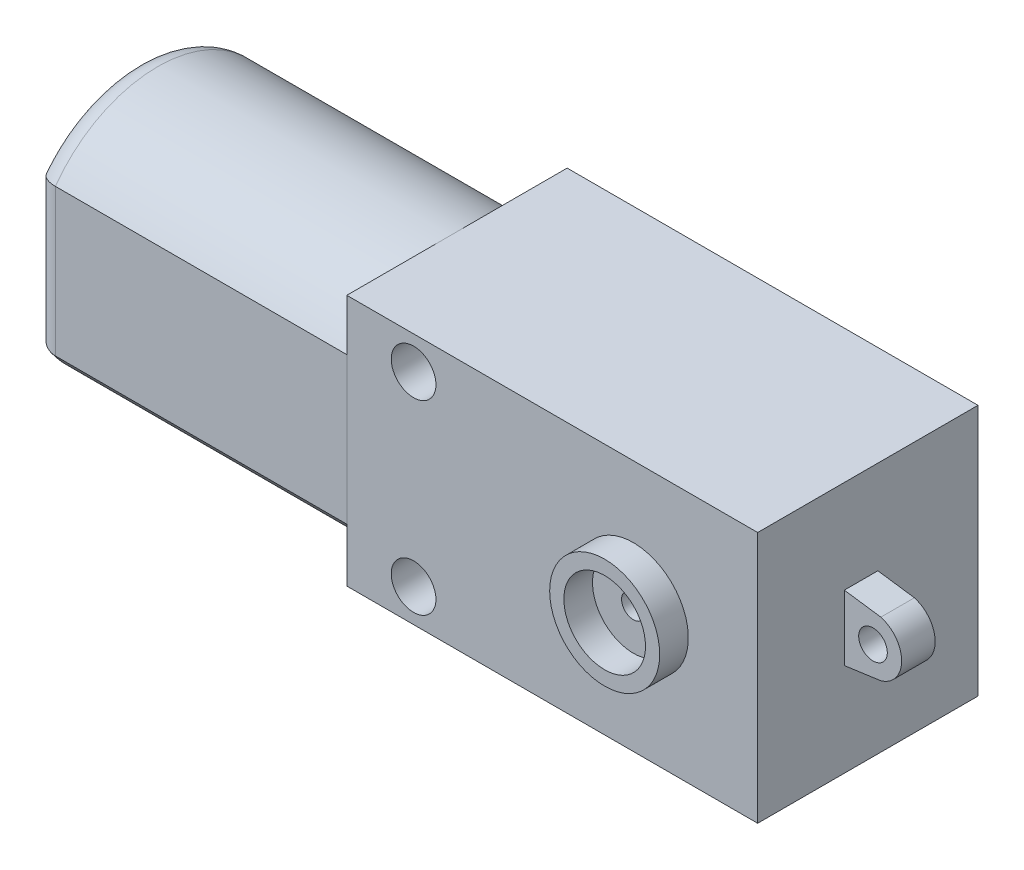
ISO-10303-21;
HEADER;
FILE_DESCRIPTION(('STEP AP214'),'2;1');
FILE_NAME('part.step','',(''),(''),'','','');
FILE_SCHEMA(('AUTOMOTIVE_DESIGN { 1 0 10303 214 1 1 1 1 }'));
ENDSEC;
DATA;
#1=APPLICATION_CONTEXT('core data for automotive mechanical design processes');
#2=APPLICATION_PROTOCOL_DEFINITION('international standard','automotive_design',2000,#1);
#3=PRODUCT_CONTEXT('',#1,'mechanical');
#4=PRODUCT('Part','Part','',(#3));
#5=PRODUCT_RELATED_PRODUCT_CATEGORY('part','',(#4));
#6=PRODUCT_DEFINITION_FORMATION('','',#4);
#7=PRODUCT_DEFINITION_CONTEXT('part definition',#1,'design');
#8=PRODUCT_DEFINITION('design','',#6,#7);
#9=PRODUCT_DEFINITION_SHAPE('','',#8);
#10=(LENGTH_UNIT() NAMED_UNIT(*) SI_UNIT(.MILLI.,.METRE.));
#11=(NAMED_UNIT(*) PLANE_ANGLE_UNIT() SI_UNIT($,.RADIAN.));
#12=(NAMED_UNIT(*) SI_UNIT($,.STERADIAN.) SOLID_ANGLE_UNIT());
#13=UNCERTAINTY_MEASURE_WITH_UNIT(LENGTH_MEASURE(1.E-05),#10,'distance_accuracy_value','');
#14=(GEOMETRIC_REPRESENTATION_CONTEXT(3) GLOBAL_UNCERTAINTY_ASSIGNED_CONTEXT((#13)) GLOBAL_UNIT_ASSIGNED_CONTEXT((#10,
#11,#12)) REPRESENTATION_CONTEXT('',''));
#15=CARTESIAN_POINT('',(0.,0.,0.));
#16=DIRECTION('',(0.,0.,1.));
#17=DIRECTION('',(1.,0.,0.));
#18=AXIS2_PLACEMENT_3D('',#15,#16,#17);
#19=CARTESIAN_POINT('',(-27.94,0.,0.));
#20=DIRECTION('',(-1.,0.,0.));
#21=DIRECTION('',(0.,0.,1.));
#22=AXIS2_PLACEMENT_3D('',#19,#20,#21);
#23=PLANE('',#22);
#24=CARTESIAN_POINT('',(-27.94,0.,0.));
#25=DIRECTION('',(-1.,0.,0.));
#26=DIRECTION('',(0.,0.,1.));
#27=AXIS2_PLACEMENT_3D('',#24,#25,#26);
#28=CIRCLE('',#27,9.1633);
#29=CARTESIAN_POINT('',(-27.94,5.83006436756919,7.0694));
#30=VERTEX_POINT('',#29);
#31=CARTESIAN_POINT('',(-27.94,5.70664266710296,-7.1694));
#32=VERTEX_POINT('',#31);
#33=EDGE_CURVE('E466',#30,#32,#28,.T.);
#34=ORIENTED_EDGE('',*,*,#33,.T.);
#35=DIRECTION('',(0.,-1.,0.));
#36=VECTOR('',#35,1.);
#37=CARTESIAN_POINT('',(-27.94,-6.36721057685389,-7.1694));
#38=LINE('',#37,#36);
#39=CARTESIAN_POINT('',(-27.94,-5.70664266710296,-7.1694));
#40=VERTEX_POINT('',#39);
#41=EDGE_CURVE('E252',#32,#40,#38,.T.);
#42=ORIENTED_EDGE('',*,*,#41,.T.);
#43=CARTESIAN_POINT('',(-27.94,0.,0.));
#44=DIRECTION('',(-1.,0.,0.));
#45=DIRECTION('',(0.,0.,1.));
#46=AXIS2_PLACEMENT_3D('',#43,#44,#45);
#47=CIRCLE('',#46,9.1633);
#48=CARTESIAN_POINT('',(-27.94,-5.83006436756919,7.0694));
#49=VERTEX_POINT('',#48);
#50=EDGE_CURVE('E458',#40,#49,#47,.T.);
#51=ORIENTED_EDGE('',*,*,#50,.T.);
#52=DIRECTION('',(0.,1.,0.));
#53=VECTOR('',#52,1.);
#54=CARTESIAN_POINT('',(-27.94,0.,7.0694));
#55=LINE('',#54,#53);
#56=EDGE_CURVE('E461',#49,#30,#55,.T.);
#57=ORIENTED_EDGE('',*,*,#56,.T.);
#58=EDGE_LOOP('',(#34,#42,#51,#57));
#59=FACE_BOUND('',#58,.T.);
#60=CARTESIAN_POINT('',(-27.94,0.,0.));
#61=DIRECTION('',(-1.,0.,0.));
#62=DIRECTION('',(0.,0.,1.));
#63=AXIS2_PLACEMENT_3D('',#60,#61,#62);
#64=CIRCLE('',#63,2.69917026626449);
#65=CARTESIAN_POINT('',(-27.94,0.,2.69917026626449));
#66=VERTEX_POINT('',#65);
#67=EDGE_CURVE('E457',#66,#66,#64,.F.);
#68=ORIENTED_EDGE('',*,*,#67,.T.);
#69=EDGE_LOOP('',(#68));
#70=FACE_BOUND('',#69,.T.);
#71=ADVANCED_FACE('F88',(#59,#70),#23,.T.);
#72=CARTESIAN_POINT('',(-27.94,0.,0.));
#73=DIRECTION('',(1.,0.,0.));
#74=DIRECTION('',(0.,0.,-1.));
#75=AXIS2_PLACEMENT_3D('',#72,#73,#74);
#76=CYLINDRICAL_SURFACE('',#75,11.1633);
#77=DIRECTION('',(1.,0.,0.));
#78=VECTOR('',#77,1.);
#79=CARTESIAN_POINT('',(-27.94,-6.50885938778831,9.0694));
#80=LINE('',#79,#78);
#81=CARTESIAN_POINT('',(-25.94,-6.50885938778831,9.0694));
#82=VERTEX_POINT('',#81);
#83=CARTESIAN_POINT('',(0.,-6.50885938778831,9.0694));
#84=VERTEX_POINT('',#83);
#85=EDGE_CURVE('E198',#82,#84,#80,.T.);
#86=ORIENTED_EDGE('',*,*,#85,.F.);
#87=CARTESIAN_POINT('',(-25.94,0.,0.));
#88=DIRECTION('',(-1.,0.,0.));
#89=DIRECTION('',(0.,0.,1.));
#90=AXIS2_PLACEMENT_3D('',#87,#88,#89);
#91=CIRCLE('',#90,11.1633);
#92=CARTESIAN_POINT('',(-25.94,-6.36721057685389,-9.1694));
#93=VERTEX_POINT('',#92);
#94=EDGE_CURVE('E12',#82,#93,#91,.F.);
#95=ORIENTED_EDGE('',*,*,#94,.T.);
#96=DIRECTION('',(1.,0.,0.));
#97=VECTOR('',#96,1.);
#98=CARTESIAN_POINT('',(-27.94,-6.36721057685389,-9.1694));
#99=LINE('',#98,#97);
#100=CARTESIAN_POINT('',(0.,-6.36721057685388,-9.1694));
#101=VERTEX_POINT('',#100);
#102=EDGE_CURVE('E248',#93,#101,#99,.T.);
#103=ORIENTED_EDGE('',*,*,#102,.T.);
#104=CARTESIAN_POINT('',(0.,0.,0.));
#105=DIRECTION('',(-1.,0.,0.));
#106=DIRECTION('',(0.,0.,1.));
#107=AXIS2_PLACEMENT_3D('',#104,#105,#106);
#108=CIRCLE('',#107,11.1633);
#109=CARTESIAN_POINT('',(0.,-11.1633,0.));
#110=VERTEX_POINT('',#109);
#111=EDGE_CURVE('E221',#101,#110,#108,.T.);
#112=ORIENTED_EDGE('',*,*,#111,.T.);
#113=EDGE_CURVE('E213',#110,#84,#108,.T.);
#114=ORIENTED_EDGE('',*,*,#113,.T.);
#115=EDGE_LOOP('',(#86,#95,#103,#112,#114));
#116=FACE_BOUND('',#115,.T.);
#117=ADVANCED_FACE('F219',(#116),#76,.T.);
#118=CARTESIAN_POINT('',(-27.94,0.,0.));
#119=DIRECTION('',(1.,0.,0.));
#120=DIRECTION('',(0.,0.,-1.));
#121=AXIS2_PLACEMENT_3D('',#118,#119,#120);
#122=CYLINDRICAL_SURFACE('',#121,11.1633);
#123=DIRECTION('',(1.,0.,0.));
#124=VECTOR('',#123,1.);
#125=CARTESIAN_POINT('',(-27.94,6.36721057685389,-9.1694));
#126=LINE('',#125,#124);
#127=CARTESIAN_POINT('',(-25.94,6.36721057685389,-9.1694));
#128=VERTEX_POINT('',#127);
#129=CARTESIAN_POINT('',(0.,6.36721057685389,-9.1694));
#130=VERTEX_POINT('',#129);
#131=EDGE_CURVE('E251',#128,#130,#126,.T.);
#132=ORIENTED_EDGE('',*,*,#131,.F.);
#133=CARTESIAN_POINT('',(-25.94,0.,0.));
#134=DIRECTION('',(-1.,0.,0.));
#135=DIRECTION('',(0.,0.,1.));
#136=AXIS2_PLACEMENT_3D('',#133,#134,#135);
#137=CIRCLE('',#136,11.1633);
#138=CARTESIAN_POINT('',(-25.94,6.50885938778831,9.0694));
#139=VERTEX_POINT('',#138);
#140=EDGE_CURVE('E116',#128,#139,#137,.F.);
#141=ORIENTED_EDGE('',*,*,#140,.T.);
#142=DIRECTION('',(1.,0.,0.));
#143=VECTOR('',#142,1.);
#144=CARTESIAN_POINT('',(-27.94,6.50885938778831,9.0694));
#145=LINE('',#144,#143);
#146=CARTESIAN_POINT('',(0.,6.50885938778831,9.0694));
#147=VERTEX_POINT('',#146);
#148=EDGE_CURVE('E459',#147,#139,#145,.F.);
#149=ORIENTED_EDGE('',*,*,#148,.F.);
#150=CARTESIAN_POINT('',(0.,0.,0.));
#151=DIRECTION('',(-1.,0.,0.));
#152=DIRECTION('',(0.,0.,1.));
#153=AXIS2_PLACEMENT_3D('',#150,#151,#152);
#154=CIRCLE('',#153,11.1633);
#155=CARTESIAN_POINT('',(0.,11.1633,0.));
#156=VERTEX_POINT('',#155);
#157=EDGE_CURVE('E216',#147,#156,#154,.T.);
#158=ORIENTED_EDGE('',*,*,#157,.T.);
#159=EDGE_CURVE('E223',#156,#130,#154,.T.);
#160=ORIENTED_EDGE('',*,*,#159,.T.);
#161=EDGE_LOOP('',(#132,#141,#149,#158,#160));
#162=FACE_BOUND('',#161,.T.);
#163=ADVANCED_FACE('F305',(#162),#122,.T.);
#164=CARTESIAN_POINT('',(36.4236,-11.1633,-10.3632));
#165=DIRECTION('',(0.,0.,-1.));
#166=DIRECTION('',(-1.,0.,0.));
#167=AXIS2_PLACEMENT_3D('',#164,#165,#166);
#168=PLANE('',#167);
#169=DIRECTION('',(0.,-1.,0.));
#170=VECTOR('',#169,1.);
#171=CARTESIAN_POINT('',(36.4236,11.1633,-10.3632));
#172=LINE('',#171,#170);
#173=CARTESIAN_POINT('',(36.4236,11.1633,-10.3632));
#174=VERTEX_POINT('',#173);
#175=CARTESIAN_POINT('',(36.4236,-11.1633,-10.3632));
#176=VERTEX_POINT('',#175);
#177=EDGE_CURVE('E520',#174,#176,#172,.T.);
#178=ORIENTED_EDGE('',*,*,#177,.T.);
#179=DIRECTION('',(-1.,0.,0.));
#180=VECTOR('',#179,1.);
#181=CARTESIAN_POINT('',(36.4236,-11.1633,-10.3632));
#182=LINE('',#181,#180);
#183=CARTESIAN_POINT('',(0.,-11.1633,-10.3632));
#184=VERTEX_POINT('',#183);
#185=EDGE_CURVE('E517',#176,#184,#182,.T.);
#186=ORIENTED_EDGE('',*,*,#185,.T.);
#187=DIRECTION('',(0.,1.,0.));
#188=VECTOR('',#187,1.);
#189=CARTESIAN_POINT('',(0.,11.1633,-10.3632));
#190=LINE('',#189,#188);
#191=CARTESIAN_POINT('',(0.,11.1633,-10.3632));
#192=VERTEX_POINT('',#191);
#193=EDGE_CURVE('E511',#184,#192,#190,.T.);
#194=ORIENTED_EDGE('',*,*,#193,.T.);
#195=DIRECTION('',(1.,0.,0.));
#196=VECTOR('',#195,1.);
#197=CARTESIAN_POINT('',(36.4236,11.1633,-10.3632));
#198=LINE('',#197,#196);
#199=EDGE_CURVE('E487',#192,#174,#198,.T.);
#200=ORIENTED_EDGE('',*,*,#199,.T.);
#201=EDGE_LOOP('',(#178,#186,#194,#200));
#202=FACE_BOUND('',#201,.T.);
#203=CARTESIAN_POINT('',(25.4,0.,-10.3632));
#204=DIRECTION('',(0.,0.,-1.));
#205=DIRECTION('',(-1.,0.,0.));
#206=AXIS2_PLACEMENT_3D('',#203,#204,#205);
#207=CIRCLE('',#206,1.0414);
#208=CARTESIAN_POINT('',(24.3586,0.,-10.3632));
#209=VERTEX_POINT('',#208);
#210=EDGE_CURVE('E524',#209,#209,#207,.F.);
#211=ORIENTED_EDGE('',*,*,#210,.T.);
#212=EDGE_LOOP('',(#211));
#213=FACE_BOUND('',#212,.T.);
#214=CARTESIAN_POINT('',(5.9182,8.2423,-10.3632));
#215=DIRECTION('',(0.,0.,-1.));
#216=DIRECTION('',(-1.,0.,0.));
#217=AXIS2_PLACEMENT_3D('',#214,#215,#216);
#218=CIRCLE('',#217,1.9812);
#219=CARTESIAN_POINT('',(3.937,8.2423,-10.3632));
#220=VERTEX_POINT('',#219);
#221=EDGE_CURVE('E530',#220,#220,#218,.F.);
#222=ORIENTED_EDGE('',*,*,#221,.T.);
#223=EDGE_LOOP('',(#222));
#224=FACE_BOUND('',#223,.T.);
#225=CARTESIAN_POINT('',(5.9182,-8.2423,-10.3632));
#226=DIRECTION('',(0.,0.,-1.));
#227=DIRECTION('',(-1.,0.,0.));
#228=AXIS2_PLACEMENT_3D('',#225,#226,#227);
#229=CIRCLE('',#228,1.9812);
#230=CARTESIAN_POINT('',(3.937,-8.2423,-10.3632));
#231=VERTEX_POINT('',#230);
#232=EDGE_CURVE('E534',#231,#231,#229,.F.);
#233=ORIENTED_EDGE('',*,*,#232,.T.);
#234=EDGE_LOOP('',(#233));
#235=FACE_BOUND('',#234,.T.);
#236=CARTESIAN_POINT('',(14.5542,0.,-10.3632));
#237=DIRECTION('',(0.,0.,-1.));
#238=DIRECTION('',(-1.,0.,0.));
#239=AXIS2_PLACEMENT_3D('',#236,#237,#238);
#240=CIRCLE('',#239,1.8542);
#241=CARTESIAN_POINT('',(12.7,0.,-10.3632));
#242=VERTEX_POINT('',#241);
#243=EDGE_CURVE('E205',#242,#242,#240,.T.);
#244=ORIENTED_EDGE('',*,*,#243,.F.);
#245=EDGE_LOOP('',(#244));
#246=FACE_BOUND('',#245,.T.);
#247=ADVANCED_FACE('F313',(#202,#213,#224,#235,#246),#168,.T.);
#248=CARTESIAN_POINT('',(36.4236,11.1633,-9.1694));
#249=DIRECTION('',(0.,0.,1.));
#250=DIRECTION('',(1.,0.,0.));
#251=AXIS2_PLACEMENT_3D('',#248,#249,#250);
#252=PLANE('',#251);
#253=ORIENTED_EDGE('',*,*,#102,.F.);
#254=DIRECTION('',(0.,-1.,0.));
#255=VECTOR('',#254,1.);
#256=CARTESIAN_POINT('',(-25.94,6.36721057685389,-9.1694));
#257=LINE('',#256,#255);
#258=EDGE_CURVE('E256',#93,#128,#257,.F.);
#259=ORIENTED_EDGE('',*,*,#258,.T.);
#260=ORIENTED_EDGE('',*,*,#131,.T.);
#261=DIRECTION('',(0.,1.,0.));
#262=VECTOR('',#261,1.);
#263=CARTESIAN_POINT('',(0.,11.1633,-9.1694));
#264=LINE('',#263,#262);
#265=EDGE_CURVE('E226',#101,#130,#264,.T.);
#266=ORIENTED_EDGE('',*,*,#265,.F.);
#267=EDGE_LOOP('',(#253,#259,#260,#266));
#268=FACE_BOUND('',#267,.T.);
#269=ADVANCED_FACE('F328',(#268),#252,.F.);
#270=CARTESIAN_POINT('',(36.4236,11.1633,9.1694));
#271=DIRECTION('',(0.,0.,-1.));
#272=DIRECTION('',(-1.,0.,0.));
#273=AXIS2_PLACEMENT_3D('',#270,#271,#272);
#274=PLANE('',#273);
#275=CARTESIAN_POINT('',(5.9182,-8.2423,9.1694));
#276=DIRECTION('',(0.,0.,1.));
#277=DIRECTION('',(1.,0.,0.));
#278=AXIS2_PLACEMENT_3D('',#275,#276,#277);
#279=CIRCLE('',#278,1.9812);
#280=CARTESIAN_POINT('',(7.8994,-8.2423,9.1694));
#281=VERTEX_POINT('',#280);
#282=EDGE_CURVE('E362',#281,#281,#279,.T.);
#283=ORIENTED_EDGE('',*,*,#282,.F.);
#284=EDGE_LOOP('',(#283));
#285=FACE_BOUND('',#284,.T.);
#286=CARTESIAN_POINT('',(5.9182,8.2423,9.1694));
#287=DIRECTION('',(0.,0.,1.));
#288=DIRECTION('',(1.,0.,0.));
#289=AXIS2_PLACEMENT_3D('',#286,#287,#288);
#290=CIRCLE('',#289,1.9812);
#291=CARTESIAN_POINT('',(7.8994,8.2423,9.1694));
#292=VERTEX_POINT('',#291);
#293=EDGE_CURVE('E366',#292,#292,#290,.T.);
#294=ORIENTED_EDGE('',*,*,#293,.F.);
#295=EDGE_LOOP('',(#294));
#296=FACE_BOUND('',#295,.T.);
#297=DIRECTION('',(0.,-1.,0.));
#298=VECTOR('',#297,1.);
#299=CARTESIAN_POINT('',(0.,11.1633,9.1694));
#300=LINE('',#299,#298);
#301=CARTESIAN_POINT('',(0.,11.1633,9.1694));
#302=VERTEX_POINT('',#301);
#303=CARTESIAN_POINT('',(0.,-11.1633,9.1694));
#304=VERTEX_POINT('',#303);
#305=EDGE_CURVE('E255',#302,#304,#300,.T.);
#306=ORIENTED_EDGE('',*,*,#305,.T.);
#307=DIRECTION('',(-1.,0.,0.));
#308=VECTOR('',#307,1.);
#309=CARTESIAN_POINT('',(36.4236,-11.1633,9.1694));
#310=LINE('',#309,#308);
#311=CARTESIAN_POINT('',(36.4236,-11.1633,9.1694));
#312=VERTEX_POINT('',#311);
#313=EDGE_CURVE('E229',#312,#304,#310,.T.);
#314=ORIENTED_EDGE('',*,*,#313,.F.);
#315=DIRECTION('',(0.,-1.,0.));
#316=VECTOR('',#315,1.);
#317=CARTESIAN_POINT('',(36.4236,11.1633,9.1694));
#318=LINE('',#317,#316);
#319=CARTESIAN_POINT('',(36.4236,11.1633,9.1694));
#320=VERTEX_POINT('',#319);
#321=EDGE_CURVE('E800',#320,#312,#318,.T.);
#322=ORIENTED_EDGE('',*,*,#321,.F.);
#323=DIRECTION('',(-1.,0.,0.));
#324=VECTOR('',#323,1.);
#325=CARTESIAN_POINT('',(36.4236,11.1633,9.1694));
#326=LINE('',#325,#324);
#327=EDGE_CURVE('E814',#320,#302,#326,.T.);
#328=ORIENTED_EDGE('',*,*,#327,.T.);
#329=EDGE_LOOP('',(#306,#314,#322,#328));
#330=FACE_BOUND('',#329,.T.);
#331=CARTESIAN_POINT('',(25.4,0.,9.1694));
#332=DIRECTION('',(0.,0.,-1.));
#333=DIRECTION('',(-1.,0.,0.));
#334=AXIS2_PLACEMENT_3D('',#331,#332,#333);
#335=CIRCLE('',#334,4.8768);
#336=CARTESIAN_POINT('',(20.5232,0.,9.1694));
#337=VERTEX_POINT('',#336);
#338=EDGE_CURVE('E222',#337,#337,#335,.F.);
#339=ORIENTED_EDGE('',*,*,#338,.F.);
#340=EDGE_LOOP('',(#339));
#341=FACE_BOUND('',#340,.T.);
#342=ADVANCED_FACE('F331',(#285,#296,#330,#341),#274,.F.);
#343=CARTESIAN_POINT('',(41.5036,2.8956,1.48589999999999));
#344=DIRECTION('',(0.,0.,-1.));
#345=DIRECTION('',(0.,1.,0.));
#346=AXIS2_PLACEMENT_3D('',#343,#344,#345);
#347=PLANE('',#346);
#348=CARTESIAN_POINT('',(38.9636,0.,1.48589999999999));
#349=DIRECTION('',(0.,0.,1.));
#350=DIRECTION('',(1.,0.,0.));
#351=AXIS2_PLACEMENT_3D('',#348,#349,#350);
#352=CIRCLE('',#351,1.27);
#353=CARTESIAN_POINT('',(40.2336,0.,1.48589999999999));
#354=VERTEX_POINT('',#353);
#355=EDGE_CURVE('E418',#354,#354,#352,.T.);
#356=ORIENTED_EDGE('',*,*,#355,.F.);
#357=EDGE_LOOP('',(#356));
#358=FACE_BOUND('',#357,.T.);
#359=CARTESIAN_POINT('',(38.9636,0.,1.48589999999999));
#360=DIRECTION('',(0.,0.,1.));
#361=DIRECTION('',(1.,0.,0.));
#362=AXIS2_PLACEMENT_3D('',#359,#360,#361);
#363=CIRCLE('',#362,2.54);
#364=CARTESIAN_POINT('',(39.6611284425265,-2.44234601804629,1.48589999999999));
#365=VERTEX_POINT('',#364);
#366=CARTESIAN_POINT('',(39.6611284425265,2.44234601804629,1.48589999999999));
#367=VERTEX_POINT('',#366);
#368=EDGE_CURVE('E428',#365,#367,#363,.T.);
#369=ORIENTED_EDGE('',*,*,#368,.T.);
#370=DIRECTION('',(-0.99034174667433,0.138647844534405,0.));
#371=VECTOR('',#370,1.);
#372=CARTESIAN_POINT('',(40.1545285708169,2.37327000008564,1.48589999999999));
#373=LINE('',#372,#371);
#374=CARTESIAN_POINT('',(36.4236,2.8956,1.48589999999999));
#375=VERTEX_POINT('',#374);
#376=EDGE_CURVE('E421',#367,#375,#373,.T.);
#377=ORIENTED_EDGE('',*,*,#376,.T.);
#378=DIRECTION('',(0.,-1.,0.));
#379=VECTOR('',#378,1.);
#380=CARTESIAN_POINT('',(36.4236,2.8956,1.48589999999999));
#381=LINE('',#380,#379);
#382=CARTESIAN_POINT('',(36.4236,-2.8956,1.48589999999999));
#383=VERTEX_POINT('',#382);
#384=EDGE_CURVE('E438',#375,#383,#381,.T.);
#385=ORIENTED_EDGE('',*,*,#384,.T.);
#386=DIRECTION('',(-0.99034174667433,-0.138647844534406,0.));
#387=VECTOR('',#386,1.);
#388=CARTESIAN_POINT('',(38.4701998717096,-2.60907601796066,1.48589999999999));
#389=LINE('',#388,#387);
#390=EDGE_CURVE('E434',#365,#383,#389,.T.);
#391=ORIENTED_EDGE('',*,*,#390,.F.);
#392=EDGE_LOOP('',(#369,#377,#385,#391));
#393=FACE_BOUND('',#392,.T.);
#394=ADVANCED_FACE('F353',(#358,#393),#347,.F.);
#395=CARTESIAN_POINT('',(41.5036,2.8956,-1.48590000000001));
#396=DIRECTION('',(0.,0.,1.));
#397=DIRECTION('',(0.,-1.,0.));
#398=AXIS2_PLACEMENT_3D('',#395,#396,#397);
#399=PLANE('',#398);
#400=CARTESIAN_POINT('',(38.9636,0.,-1.48590000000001));
#401=DIRECTION('',(0.,0.,1.));
#402=DIRECTION('',(0.,-1.,0.));
#403=AXIS2_PLACEMENT_3D('',#400,#401,#402);
#404=CIRCLE('',#403,1.27);
#405=CARTESIAN_POINT('',(38.9636,-1.27,-1.4859));
#406=VERTEX_POINT('',#405);
#407=EDGE_CURVE('E406',#406,#406,#404,.F.);
#408=ORIENTED_EDGE('',*,*,#407,.F.);
#409=EDGE_LOOP('',(#408));
#410=FACE_BOUND('',#409,.T.);
#411=DIRECTION('',(0.99034174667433,-0.138647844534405,0.));
#412=VECTOR('',#411,1.);
#413=CARTESIAN_POINT('',(40.1545285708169,2.37327000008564,-1.48590000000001));
#414=LINE('',#413,#412);
#415=CARTESIAN_POINT('',(36.4236,2.8956,-1.48590000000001));
#416=VERTEX_POINT('',#415);
#417=CARTESIAN_POINT('',(39.6611284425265,2.44234601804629,-1.48590000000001));
#418=VERTEX_POINT('',#417);
#419=EDGE_CURVE('E410',#416,#418,#414,.T.);
#420=ORIENTED_EDGE('',*,*,#419,.T.);
#421=CARTESIAN_POINT('',(38.9636,0.,-1.48590000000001));
#422=DIRECTION('',(0.,0.,1.));
#423=DIRECTION('',(0.,-1.,0.));
#424=AXIS2_PLACEMENT_3D('',#421,#422,#423);
#425=CIRCLE('',#424,2.54);
#426=CARTESIAN_POINT('',(39.6611284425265,-2.44234601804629,-1.4859));
#427=VERTEX_POINT('',#426);
#428=EDGE_CURVE('E412',#418,#427,#425,.F.);
#429=ORIENTED_EDGE('',*,*,#428,.T.);
#430=DIRECTION('',(0.99034174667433,0.138647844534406,0.));
#431=VECTOR('',#430,1.);
#432=CARTESIAN_POINT('',(38.4701998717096,-2.60907601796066,-1.4859));
#433=LINE('',#432,#431);
#434=CARTESIAN_POINT('',(36.4236,-2.8956,-1.4859));
#435=VERTEX_POINT('',#434);
#436=EDGE_CURVE('E431',#435,#427,#433,.T.);
#437=ORIENTED_EDGE('',*,*,#436,.F.);
#438=DIRECTION('',(0.,1.,0.));
#439=VECTOR('',#438,1.);
#440=CARTESIAN_POINT('',(36.4236,2.8956,-1.48590000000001));
#441=LINE('',#440,#439);
#442=EDGE_CURVE('E414',#435,#416,#441,.T.);
#443=ORIENTED_EDGE('',*,*,#442,.T.);
#444=EDGE_LOOP('',(#420,#429,#437,#443));
#445=FACE_BOUND('',#444,.T.);
#446=ADVANCED_FACE('F318',(#410,#445),#399,.F.);
#447=CARTESIAN_POINT('',(36.4236,-11.1633,9.1694));
#448=DIRECTION('',(1.,0.,0.));
#449=DIRECTION('',(0.,0.,-1.));
#450=AXIS2_PLACEMENT_3D('',#447,#448,#449);
#451=PLANE('',#450);
#452=ORIENTED_EDGE('',*,*,#321,.T.);
#453=DIRECTION('',(0.,0.,-1.));
#454=VECTOR('',#453,1.);
#455=CARTESIAN_POINT('',(36.4236,-11.1633,9.1694));
#456=LINE('',#455,#454);
#457=EDGE_CURVE('E798',#312,#176,#456,.T.);
#458=ORIENTED_EDGE('',*,*,#457,.T.);
#459=ORIENTED_EDGE('',*,*,#177,.F.);
#460=DIRECTION('',(0.,0.,1.));
#461=VECTOR('',#460,1.);
#462=CARTESIAN_POINT('',(36.4236,11.1633,9.1694));
#463=LINE('',#462,#461);
#464=EDGE_CURVE('E796',#174,#320,#463,.T.);
#465=ORIENTED_EDGE('',*,*,#464,.T.);
#466=EDGE_LOOP('',(#452,#458,#459,#465));
#467=FACE_BOUND('',#466,.T.);
#468=DIRECTION('',(0.,0.,-1.));
#469=VECTOR('',#468,1.);
#470=CARTESIAN_POINT('',(36.4236,-2.8956,1.4859));
#471=LINE('',#470,#469);
#472=EDGE_CURVE('E441',#383,#435,#471,.T.);
#473=ORIENTED_EDGE('',*,*,#472,.F.);
#474=ORIENTED_EDGE('',*,*,#384,.F.);
#475=DIRECTION('',(0.,0.,1.));
#476=VECTOR('',#475,1.);
#477=CARTESIAN_POINT('',(36.4236,2.8956,1.48589999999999));
#478=LINE('',#477,#476);
#479=EDGE_CURVE('E443',#416,#375,#478,.T.);
#480=ORIENTED_EDGE('',*,*,#479,.F.);
#481=ORIENTED_EDGE('',*,*,#442,.F.);
#482=EDGE_LOOP('',(#473,#474,#480,#481));
#483=FACE_BOUND('',#482,.T.);
#484=ADVANCED_FACE('F315',(#467,#483),#451,.T.);
#485=CARTESIAN_POINT('',(0.,-11.1633,9.1694));
#486=DIRECTION('',(1.,0.,0.));
#487=DIRECTION('',(0.,0.,-1.));
#488=AXIS2_PLACEMENT_3D('',#485,#486,#487);
#489=PLANE('',#488);
#490=ORIENTED_EDGE('',*,*,#305,.F.);
#491=DIRECTION('',(0.,0.,1.));
#492=VECTOR('',#491,1.);
#493=CARTESIAN_POINT('',(0.,11.1633,9.1694));
#494=LINE('',#493,#492);
#495=EDGE_CURVE('E806',#156,#302,#494,.T.);
#496=ORIENTED_EDGE('',*,*,#495,.F.);
#497=ORIENTED_EDGE('',*,*,#157,.F.);
#498=DIRECTION('',(0.,1.,0.));
#499=VECTOR('',#498,1.);
#500=CARTESIAN_POINT('',(0.,16.0531211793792,9.0694));
#501=LINE('',#500,#499);
#502=EDGE_CURVE('E201',#84,#147,#501,.T.);
#503=ORIENTED_EDGE('',*,*,#502,.F.);
#504=ORIENTED_EDGE('',*,*,#113,.F.);
#505=DIRECTION('',(0.,0.,-1.));
#506=VECTOR('',#505,1.);
#507=CARTESIAN_POINT('',(0.,-11.1633,9.1694));
#508=LINE('',#507,#506);
#509=EDGE_CURVE('E804',#304,#110,#508,.T.);
#510=ORIENTED_EDGE('',*,*,#509,.F.);
#511=EDGE_LOOP('',(#490,#496,#497,#503,#504,#510));
#512=FACE_BOUND('',#511,.T.);
#513=ADVANCED_FACE('F211',(#512),#489,.F.);
#514=ORIENTED_EDGE('',*,*,#159,.F.);
#515=EDGE_CURVE('E811',#192,#156,#494,.T.);
#516=ORIENTED_EDGE('',*,*,#515,.F.);
#517=ORIENTED_EDGE('',*,*,#193,.F.);
#518=EDGE_CURVE('E803',#110,#184,#508,.T.);
#519=ORIENTED_EDGE('',*,*,#518,.F.);
#520=ORIENTED_EDGE('',*,*,#111,.F.);
#521=ORIENTED_EDGE('',*,*,#265,.T.);
#522=EDGE_LOOP('',(#514,#516,#517,#519,#520,#521));
#523=FACE_BOUND('',#522,.T.);
#524=ADVANCED_FACE('F322',(#523),#489,.F.);
#525=CARTESIAN_POINT('',(36.4236,-11.1633,9.1694));
#526=DIRECTION('',(0.,1.,0.));
#527=DIRECTION('',(0.,0.,1.));
#528=AXIS2_PLACEMENT_3D('',#525,#526,#527);
#529=PLANE('',#528);
#530=ORIENTED_EDGE('',*,*,#509,.T.);
#531=ORIENTED_EDGE('',*,*,#518,.T.);
#532=ORIENTED_EDGE('',*,*,#185,.F.);
#533=ORIENTED_EDGE('',*,*,#457,.F.);
#534=ORIENTED_EDGE('',*,*,#313,.T.);
#535=EDGE_LOOP('',(#530,#531,#532,#533,#534));
#536=FACE_BOUND('',#535,.T.);
#537=ADVANCED_FACE('F326',(#536),#529,.F.);
#538=CARTESIAN_POINT('',(36.4236,11.1633,9.1694));
#539=DIRECTION('',(0.,-1.,0.));
#540=DIRECTION('',(0.,0.,-1.));
#541=AXIS2_PLACEMENT_3D('',#538,#539,#540);
#542=PLANE('',#541);
#543=ORIENTED_EDGE('',*,*,#515,.T.);
#544=ORIENTED_EDGE('',*,*,#495,.T.);
#545=ORIENTED_EDGE('',*,*,#327,.F.);
#546=ORIENTED_EDGE('',*,*,#464,.F.);
#547=ORIENTED_EDGE('',*,*,#199,.F.);
#548=EDGE_LOOP('',(#543,#544,#545,#546,#547));
#549=FACE_BOUND('',#548,.T.);
#550=ADVANCED_FACE('F323',(#549),#542,.F.);
#551=CARTESIAN_POINT('',(-28.8798,0.,0.));
#552=DIRECTION('',(-1.,0.,0.));
#553=DIRECTION('',(0.,0.,1.));
#554=AXIS2_PLACEMENT_3D('',#551,#552,#553);
#555=PLANE('',#554);
#556=CARTESIAN_POINT('',(-28.8798,0.,0.));
#557=DIRECTION('',(-1.,0.,0.));
#558=DIRECTION('',(0.,0.,1.));
#559=AXIS2_PLACEMENT_3D('',#556,#557,#558);
#560=CIRCLE('',#559,1.0033);
#561=CARTESIAN_POINT('',(-28.8798,0.,1.0033));
#562=VERTEX_POINT('',#561);
#563=EDGE_CURVE('E239',#562,#562,#560,.T.);
#564=ORIENTED_EDGE('',*,*,#563,.T.);
#565=EDGE_LOOP('',(#564));
#566=FACE_BOUND('',#565,.T.);
#567=ADVANCED_FACE('F310',(#566),#555,.T.);
#568=CARTESIAN_POINT('',(38.9636,0.,-7.33319846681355));
#569=DIRECTION('',(0.,0.,1.));
#570=DIRECTION('',(1.,0.,0.));
#571=AXIS2_PLACEMENT_3D('',#568,#569,#570);
#572=CYLINDRICAL_SURFACE('',#571,2.54);
#573=ORIENTED_EDGE('',*,*,#428,.F.);
#574=DIRECTION('',(0.,0.,1.));
#575=VECTOR('',#574,1.);
#576=CARTESIAN_POINT('',(39.6611284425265,2.44234601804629,-7.33319846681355));
#577=LINE('',#576,#575);
#578=EDGE_CURVE('E417',#418,#367,#577,.T.);
#579=ORIENTED_EDGE('',*,*,#578,.T.);
#580=ORIENTED_EDGE('',*,*,#368,.F.);
#581=DIRECTION('',(0.,0.,1.));
#582=VECTOR('',#581,1.);
#583=CARTESIAN_POINT('',(39.6611284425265,-2.44234601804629,-7.33319846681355));
#584=LINE('',#583,#582);
#585=EDGE_CURVE('E432',#427,#365,#584,.T.);
#586=ORIENTED_EDGE('',*,*,#585,.F.);
#587=EDGE_LOOP('',(#573,#579,#580,#586));
#588=FACE_BOUND('',#587,.T.);
#589=ADVANCED_FACE('F392',(#588),#572,.T.);
#590=CARTESIAN_POINT('',(38.4701998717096,-2.60907601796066,-7.33319846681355));
#591=DIRECTION('',(-0.138647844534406,0.99034174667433,0.));
#592=DIRECTION('',(-0.99034174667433,-0.138647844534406,0.));
#593=AXIS2_PLACEMENT_3D('',#590,#591,#592);
#594=PLANE('',#593);
#595=ORIENTED_EDGE('',*,*,#436,.T.);
#596=ORIENTED_EDGE('',*,*,#585,.T.);
#597=ORIENTED_EDGE('',*,*,#390,.T.);
#598=ORIENTED_EDGE('',*,*,#472,.T.);
#599=EDGE_LOOP('',(#595,#596,#597,#598));
#600=FACE_BOUND('',#599,.T.);
#601=ADVANCED_FACE('F390',(#600),#594,.F.);
#602=CARTESIAN_POINT('',(40.1545285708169,2.37327000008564,-7.33319846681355));
#603=DIRECTION('',(0.138647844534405,0.990341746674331,0.));
#604=DIRECTION('',(-0.99034174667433,0.138647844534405,0.));
#605=AXIS2_PLACEMENT_3D('',#602,#603,#604);
#606=PLANE('',#605);
#607=ORIENTED_EDGE('',*,*,#479,.T.);
#608=ORIENTED_EDGE('',*,*,#376,.F.);
#609=ORIENTED_EDGE('',*,*,#578,.F.);
#610=ORIENTED_EDGE('',*,*,#419,.F.);
#611=EDGE_LOOP('',(#607,#608,#609,#610));
#612=FACE_BOUND('',#611,.T.);
#613=ADVANCED_FACE('F386',(#612),#606,.T.);
#614=CARTESIAN_POINT('',(38.9636,0.,-7.33319846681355));
#615=DIRECTION('',(0.,0.,1.));
#616=DIRECTION('',(1.,0.,0.));
#617=AXIS2_PLACEMENT_3D('',#614,#615,#616);
#618=CYLINDRICAL_SURFACE('',#617,1.27);
#619=ORIENTED_EDGE('',*,*,#407,.T.);
#620=EDGE_LOOP('',(#619));
#621=FACE_BOUND('',#620,.T.);
#622=ORIENTED_EDGE('',*,*,#355,.T.);
#623=EDGE_LOOP('',(#622));
#624=FACE_BOUND('',#623,.T.);
#625=ADVANCED_FACE('F379',(#621,#624),#618,.F.);
#626=CARTESIAN_POINT('',(25.4,0.,11.7094));
#627=DIRECTION('',(0.,0.,1.));
#628=DIRECTION('',(1.,0.,0.));
#629=AXIS2_PLACEMENT_3D('',#626,#627,#628);
#630=PLANE('',#629);
#631=CARTESIAN_POINT('',(25.4,0.,11.7094));
#632=DIRECTION('',(0.,0.,1.));
#633=DIRECTION('',(1.,0.,0.));
#634=AXIS2_PLACEMENT_3D('',#631,#632,#633);
#635=CIRCLE('',#634,4.8768);
#636=CARTESIAN_POINT('',(30.2768,0.,11.7094));
#637=VERTEX_POINT('',#636);
#638=EDGE_CURVE('E492',#637,#637,#635,.T.);
#639=ORIENTED_EDGE('',*,*,#638,.T.);
#640=EDGE_LOOP('',(#639));
#641=FACE_BOUND('',#640,.T.);
#642=CARTESIAN_POINT('',(25.4,0.,11.7094));
#643=DIRECTION('',(0.,0.,1.));
#644=DIRECTION('',(1.,0.,0.));
#645=AXIS2_PLACEMENT_3D('',#642,#643,#644);
#646=CIRCLE('',#645,3.6195);
#647=CARTESIAN_POINT('',(29.0195,0.,11.7094));
#648=VERTEX_POINT('',#647);
#649=EDGE_CURVE('E489',#648,#648,#646,.T.);
#650=ORIENTED_EDGE('',*,*,#649,.F.);
#651=EDGE_LOOP('',(#650));
#652=FACE_BOUND('',#651,.T.);
#653=ADVANCED_FACE('F373',(#641,#652),#630,.T.);
#654=CARTESIAN_POINT('',(25.4,0.,11.7094));
#655=DIRECTION('',(0.,0.,-1.));
#656=DIRECTION('',(-1.,0.,0.));
#657=AXIS2_PLACEMENT_3D('',#654,#655,#656);
#658=CYLINDRICAL_SURFACE('',#657,4.8768);
#659=ORIENTED_EDGE('',*,*,#638,.F.);
#660=EDGE_LOOP('',(#659));
#661=FACE_BOUND('',#660,.T.);
#662=ORIENTED_EDGE('',*,*,#338,.T.);
#663=EDGE_LOOP('',(#662));
#664=FACE_BOUND('',#663,.T.);
#665=ADVANCED_FACE('F347',(#661,#664),#658,.T.);
#666=CARTESIAN_POINT('',(25.4,0.,11.7094));
#667=DIRECTION('',(0.,0.,-1.));
#668=DIRECTION('',(-1.,0.,0.));
#669=AXIS2_PLACEMENT_3D('',#666,#667,#668);
#670=CYLINDRICAL_SURFACE('',#669,3.6195);
#671=ORIENTED_EDGE('',*,*,#649,.T.);
#672=EDGE_LOOP('',(#671));
#673=FACE_BOUND('',#672,.T.);
#674=CARTESIAN_POINT('',(25.4,0.,9.1694));
#675=DIRECTION('',(0.,0.,1.));
#676=DIRECTION('',(1.,0.,0.));
#677=AXIS2_PLACEMENT_3D('',#674,#675,#676);
#678=CIRCLE('',#677,3.6195);
#679=CARTESIAN_POINT('',(29.0195,0.,9.1694));
#680=VERTEX_POINT('',#679);
#681=EDGE_CURVE('E493',#680,#680,#678,.T.);
#682=ORIENTED_EDGE('',*,*,#681,.F.);
#683=EDGE_LOOP('',(#682));
#684=FACE_BOUND('',#683,.T.);
#685=ADVANCED_FACE('F338',(#673,#684),#670,.F.);
#686=CARTESIAN_POINT('',(25.4,0.,9.1694));
#687=DIRECTION('',(0.,0.,1.));
#688=DIRECTION('',(1.,0.,0.));
#689=AXIS2_PLACEMENT_3D('',#686,#687,#688);
#690=CIRCLE('',#689,1.0414);
#691=CARTESIAN_POINT('',(26.4414,0.,9.1694));
#692=VERTEX_POINT('',#691);
#693=EDGE_CURVE('E527',#692,#692,#690,.T.);
#694=ORIENTED_EDGE('',*,*,#693,.F.);
#695=EDGE_LOOP('',(#694));
#696=FACE_BOUND('',#695,.T.);
#697=ORIENTED_EDGE('',*,*,#681,.T.);
#698=EDGE_LOOP('',(#697));
#699=FACE_BOUND('',#698,.T.);
#700=ADVANCED_FACE('F335',(#696,#699),#274,.F.);
#701=CARTESIAN_POINT('',(25.4,0.,-15.9668798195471));
#702=DIRECTION('',(0.,0.,1.));
#703=DIRECTION('',(1.,0.,0.));
#704=AXIS2_PLACEMENT_3D('',#701,#702,#703);
#705=CYLINDRICAL_SURFACE('',#704,1.0414);
#706=ORIENTED_EDGE('',*,*,#693,.T.);
#707=EDGE_LOOP('',(#706));
#708=FACE_BOUND('',#707,.T.);
#709=ORIENTED_EDGE('',*,*,#210,.F.);
#710=EDGE_LOOP('',(#709));
#711=FACE_BOUND('',#710,.T.);
#712=ADVANCED_FACE('F337',(#708,#711),#705,.F.);
#713=CARTESIAN_POINT('',(5.9182,8.2423,-15.9668798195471));
#714=DIRECTION('',(0.,0.,1.));
#715=DIRECTION('',(1.,0.,0.));
#716=AXIS2_PLACEMENT_3D('',#713,#714,#715);
#717=CYLINDRICAL_SURFACE('',#716,1.9812);
#718=ORIENTED_EDGE('',*,*,#293,.T.);
#719=EDGE_LOOP('',(#718));
#720=FACE_BOUND('',#719,.T.);
#721=ORIENTED_EDGE('',*,*,#221,.F.);
#722=EDGE_LOOP('',(#721));
#723=FACE_BOUND('',#722,.T.);
#724=ADVANCED_FACE('F344',(#720,#723),#717,.F.);
#725=CARTESIAN_POINT('',(5.9182,-8.2423,-15.9668798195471));
#726=DIRECTION('',(0.,0.,1.));
#727=DIRECTION('',(1.,0.,0.));
#728=AXIS2_PLACEMENT_3D('',#725,#726,#727);
#729=CYLINDRICAL_SURFACE('',#728,1.9812);
#730=ORIENTED_EDGE('',*,*,#282,.T.);
#731=EDGE_LOOP('',(#730));
#732=FACE_BOUND('',#731,.T.);
#733=ORIENTED_EDGE('',*,*,#232,.F.);
#734=EDGE_LOOP('',(#733));
#735=FACE_BOUND('',#734,.T.);
#736=ADVANCED_FACE('F548',(#732,#735),#729,.F.);
#737=CARTESIAN_POINT('',(14.5542,0.,-12.1158));
#738=DIRECTION('',(0.,0.,1.));
#739=DIRECTION('',(1.,0.,0.));
#740=AXIS2_PLACEMENT_3D('',#737,#738,#739);
#741=CYLINDRICAL_SURFACE('',#740,1.8542);
#742=CARTESIAN_POINT('',(14.5542,0.,-12.1158));
#743=DIRECTION('',(0.,0.,-1.));
#744=DIRECTION('',(-1.,0.,0.));
#745=AXIS2_PLACEMENT_3D('',#742,#743,#744);
#746=CIRCLE('',#745,1.8542);
#747=CARTESIAN_POINT('',(12.7,0.,-12.1158));
#748=VERTEX_POINT('',#747);
#749=EDGE_CURVE('E538',#748,#748,#746,.T.);
#750=ORIENTED_EDGE('',*,*,#749,.F.);
#751=EDGE_LOOP('',(#750));
#752=FACE_BOUND('',#751,.T.);
#753=ORIENTED_EDGE('',*,*,#243,.T.);
#754=EDGE_LOOP('',(#753));
#755=FACE_BOUND('',#754,.T.);
#756=ADVANCED_FACE('F545',(#752,#755),#741,.T.);
#757=CARTESIAN_POINT('',(14.5542,0.,-12.1158));
#758=DIRECTION('',(0.,0.,-1.));
#759=DIRECTION('',(-1.,0.,0.));
#760=AXIS2_PLACEMENT_3D('',#757,#758,#759);
#761=PLANE('',#760);
#762=ORIENTED_EDGE('',*,*,#749,.T.);
#763=EDGE_LOOP('',(#762));
#764=FACE_BOUND('',#763,.T.);
#765=ADVANCED_FACE('F297',(#764),#761,.T.);
#766=CARTESIAN_POINT('',(-30.65384668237,-11.1633,9.0694));
#767=DIRECTION('',(0.,0.,1.));
#768=DIRECTION('',(1.,0.,0.));
#769=AXIS2_PLACEMENT_3D('',#766,#767,#768);
#770=PLANE('',#769);
#771=ORIENTED_EDGE('',*,*,#148,.T.);
#772=DIRECTION('',(0.,1.,0.));
#773=VECTOR('',#772,1.);
#774=CARTESIAN_POINT('',(-25.94,-11.1633,9.0694));
#775=LINE('',#774,#773);
#776=EDGE_CURVE('E101',#139,#82,#775,.F.);
#777=ORIENTED_EDGE('',*,*,#776,.T.);
#778=ORIENTED_EDGE('',*,*,#85,.T.);
#779=ORIENTED_EDGE('',*,*,#502,.T.);
#780=EDGE_LOOP('',(#771,#777,#778,#779));
#781=FACE_BOUND('',#780,.T.);
#782=ADVANCED_FACE('F200',(#781),#770,.T.);
#783=CARTESIAN_POINT('',(-25.94,0.,7.0694));
#784=DIRECTION('',(0.,1.,0.));
#785=DIRECTION('',(0.,0.,1.));
#786=AXIS2_PLACEMENT_3D('',#783,#784,#785);
#787=CYLINDRICAL_SURFACE('',#786,2.);
#788=CARTESIAN_POINT('',(-25.94,-6.50885938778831,9.0694));
#789=CARTESIAN_POINT('',(-25.9942592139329,-6.50885932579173,9.06940097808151));
#790=CARTESIAN_POINT('',(-26.0484917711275,-6.50814861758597,9.06719045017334));
#791=CARTESIAN_POINT('',(-26.1565546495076,-6.50531376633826,9.05838077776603));
#792=CARTESIAN_POINT('',(-26.2103850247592,-6.50318981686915,9.05178223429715));
#793=CARTESIAN_POINT('',(-26.370469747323,-6.49472557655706,9.02550485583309));
#794=CARTESIAN_POINT('',(-26.4756282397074,-6.48629278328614,8.99934382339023));
#795=CARTESIAN_POINT('',(-26.6797940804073,-6.46408511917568,8.9306694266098));
#796=CARTESIAN_POINT('',(-26.7788011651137,-6.4503100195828,8.88815536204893));
#797=CARTESIAN_POINT('',(-26.9681165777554,-6.41779512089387,8.78824525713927));
#798=CARTESIAN_POINT('',(-27.0584237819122,-6.39905468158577,8.73084729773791));
#799=CARTESIAN_POINT('',(-27.2297253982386,-6.35669700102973,8.60182523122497));
#800=CARTESIAN_POINT('',(-27.3105097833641,-6.33299370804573,8.52995109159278));
#801=CARTESIAN_POINT('',(-27.4589121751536,-6.28153147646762,8.37493653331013));
#802=CARTESIAN_POINT('',(-27.5265261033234,-6.25377128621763,8.29179263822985));
#803=CARTESIAN_POINT('',(-27.6499713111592,-6.19350574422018,8.11264822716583));
#804=CARTESIAN_POINT('',(-27.7051238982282,-6.1608416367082,8.01623409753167));
#805=CARTESIAN_POINT('',(-27.7984957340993,-6.09257574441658,7.8164905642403));
#806=CARTESIAN_POINT('',(-27.8367137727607,-6.05697374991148,7.71316066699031));
#807=CARTESIAN_POINT('',(-27.890284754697,-5.99032618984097,7.52153584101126));
#808=CARTESIAN_POINT('',(-27.9085261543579,-5.95962405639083,7.43390957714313));
#809=CARTESIAN_POINT('',(-27.9331242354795,-5.89730015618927,7.2574537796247));
#810=CARTESIAN_POINT('',(-27.9395036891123,-5.86568027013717,7.16862688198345));
#811=CARTESIAN_POINT('',(-27.9399907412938,-5.83259081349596,7.0764355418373));
#812=CARTESIAN_POINT('',(-27.9400000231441,-5.8313277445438,7.07291762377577));
#813=CARTESIAN_POINT('',(-27.94,-5.83006436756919,7.0694));
#814=B_SPLINE_CURVE_WITH_KNOTS('',3,(#788,#789,#790,#791,#792,#793,#794,#795,#796,#797,#798,
#799,#800,#801,#802,#803,#804,#805,#806,#807,#808,#809,#810,#811,#812,#813),.UNSPECIFIED.,.F.,
.F.,(4,2,2,2,2,2,2,2,2,2,2,2,4),(0.,0.162675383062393,0.325328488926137,0.649715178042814,
0.974115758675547,1.29855818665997,1.62917731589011,1.95989866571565,2.30571583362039,
2.65155770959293,2.9347280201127,3.21735414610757,3.22856750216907),.UNSPECIFIED.);
#815=EDGE_CURVE('E282',#82,#49,#814,.T.);
#816=ORIENTED_EDGE('',*,*,#815,.F.);
#817=ORIENTED_EDGE('',*,*,#776,.F.);
#818=CARTESIAN_POINT('',(-25.94,6.50885938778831,9.0694));
#819=CARTESIAN_POINT('',(-25.9942592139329,6.50885932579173,9.06940097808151));
#820=CARTESIAN_POINT('',(-26.0484917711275,6.50814861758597,9.06719045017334));
#821=CARTESIAN_POINT('',(-26.1565546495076,6.50531376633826,9.05838077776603));
#822=CARTESIAN_POINT('',(-26.2103850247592,6.50318981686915,9.05178223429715));
#823=CARTESIAN_POINT('',(-26.370469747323,6.49472557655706,9.02550485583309));
#824=CARTESIAN_POINT('',(-26.4756282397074,6.48629278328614,8.99934382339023));
#825=CARTESIAN_POINT('',(-26.6797940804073,6.46408511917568,8.9306694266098));
#826=CARTESIAN_POINT('',(-26.7788011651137,6.4503100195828,8.88815536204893));
#827=CARTESIAN_POINT('',(-26.9681165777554,6.41779512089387,8.78824525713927));
#828=CARTESIAN_POINT('',(-27.0584237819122,6.39905468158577,8.73084729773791));
#829=CARTESIAN_POINT('',(-27.2297253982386,6.35669700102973,8.60182523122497));
#830=CARTESIAN_POINT('',(-27.3105097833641,6.33299370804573,8.52995109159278));
#831=CARTESIAN_POINT('',(-27.4589121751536,6.28153147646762,8.37493653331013));
#832=CARTESIAN_POINT('',(-27.5265261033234,6.25377128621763,8.29179263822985));
#833=CARTESIAN_POINT('',(-27.6499713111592,6.19350574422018,8.11264822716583));
#834=CARTESIAN_POINT('',(-27.7051238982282,6.1608416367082,8.01623409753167));
#835=CARTESIAN_POINT('',(-27.7984957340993,6.09257574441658,7.8164905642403));
#836=CARTESIAN_POINT('',(-27.8367137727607,6.05697374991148,7.71316066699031));
#837=CARTESIAN_POINT('',(-27.890284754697,5.99032618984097,7.52153584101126));
#838=CARTESIAN_POINT('',(-27.9085261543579,5.95962405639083,7.43390957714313));
#839=CARTESIAN_POINT('',(-27.9331242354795,5.89730015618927,7.2574537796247));
#840=CARTESIAN_POINT('',(-27.9395036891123,5.86568027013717,7.16862688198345));
#841=CARTESIAN_POINT('',(-27.9399907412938,5.83259081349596,7.0764355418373));
#842=CARTESIAN_POINT('',(-27.9400000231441,5.8313277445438,7.07291762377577));
#843=CARTESIAN_POINT('',(-27.94,5.83006436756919,7.0694));
#844=B_SPLINE_CURVE_WITH_KNOTS('',3,(#818,#819,#820,#821,#822,#823,#824,#825,#826,#827,#828,
#829,#830,#831,#832,#833,#834,#835,#836,#837,#838,#839,#840,#841,#842,#843),.UNSPECIFIED.,.F.,
.F.,(4,2,2,2,2,2,2,2,2,2,2,2,4),(0.,0.162675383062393,0.325328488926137,0.649715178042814,
0.974115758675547,1.29855818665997,1.62917731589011,1.95989866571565,2.30571583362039,
2.65155770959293,2.9347280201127,3.21735414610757,3.22856750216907),.UNSPECIFIED.);
#845=EDGE_CURVE('E92',#30,#139,#844,.F.);
#846=ORIENTED_EDGE('',*,*,#845,.F.);
#847=ORIENTED_EDGE('',*,*,#56,.F.);
#848=EDGE_LOOP('',(#816,#817,#846,#847));
#849=FACE_BOUND('',#848,.T.);
#850=ADVANCED_FACE('F287',(#849),#787,.T.);
#851=CARTESIAN_POINT('',(-25.94,0.,0.));
#852=DIRECTION('',(-1.,0.,0.));
#853=DIRECTION('',(0.,0.,1.));
#854=AXIS2_PLACEMENT_3D('',#851,#852,#853);
#855=TOROIDAL_SURFACE('',#854,9.1633,2.);
#856=ORIENTED_EDGE('',*,*,#845,.T.);
#857=ORIENTED_EDGE('',*,*,#140,.F.);
#858=CARTESIAN_POINT('',(-25.94,6.36721057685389,-9.1694));
#859=CARTESIAN_POINT('',(-25.994356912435,6.36721049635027,-9.16940091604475));
#860=CARTESIAN_POINT('',(-26.048687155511,6.36651620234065,-9.16718249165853));
#861=CARTESIAN_POINT('',(-26.1569454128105,6.36374668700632,-9.15834090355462));
#862=CARTESIAN_POINT('',(-26.2108734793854,6.36167164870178,-9.15171832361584));
#863=CARTESIAN_POINT('',(-26.3712564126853,6.3534016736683,-9.12534311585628));
#864=CARTESIAN_POINT('',(-26.4766146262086,6.34516177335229,-9.09908258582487));
#865=CARTESIAN_POINT('',(-26.6811731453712,6.32345808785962,-9.03013406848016));
#866=CARTESIAN_POINT('',(-26.7803730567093,6.30999396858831,-8.98744503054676));
#867=CARTESIAN_POINT('',(-26.9700496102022,6.27820684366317,-8.8871036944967));
#868=CARTESIAN_POINT('',(-27.0605252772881,6.25988329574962,-8.82944972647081));
#869=CARTESIAN_POINT('',(-27.2320478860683,6.21847755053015,-8.69988229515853));
#870=CARTESIAN_POINT('',(-27.312893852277,6.19531500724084,-8.62772897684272));
#871=CARTESIAN_POINT('',(-27.4613722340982,6.1450197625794,-8.47208964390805));
#872=CARTESIAN_POINT('',(-27.5290005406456,6.11788583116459,-8.38860011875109));
#873=CARTESIAN_POINT('',(-27.6522670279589,6.05903680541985,-8.20888402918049));
#874=CARTESIAN_POINT('',(-27.7072567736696,6.02717391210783,-8.11226172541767));
#875=CARTESIAN_POINT('',(-27.8002677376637,5.96058335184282,-7.91208445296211));
#876=CARTESIAN_POINT('',(-27.8382883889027,5.92585558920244,-7.80852925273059));
#877=CARTESIAN_POINT('',(-27.8911801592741,5.86118231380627,-7.61747863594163));
#878=CARTESIAN_POINT('',(-27.9090819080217,5.83158647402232,-7.53068301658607));
#879=CARTESIAN_POINT('',(-27.9332311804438,5.77151848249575,-7.35590805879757));
#880=CARTESIAN_POINT('',(-27.9395009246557,5.74104811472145,-7.26793130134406));
#881=CARTESIAN_POINT('',(-27.9399904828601,5.70913455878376,-7.17653308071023));
#882=CARTESIAN_POINT('',(-27.9400000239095,5.70788876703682,-7.1729663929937));
#883=CARTESIAN_POINT('',(-27.94,5.70664266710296,-7.1694));
#884=B_SPLINE_CURVE_WITH_KNOTS('',3,(#858,#859,#860,#861,#862,#863,#864,#865,#866,#867,#868,
#869,#870,#871,#872,#873,#874,#875,#876,#877,#878,#879,#880,#881,#882,#883),.UNSPECIFIED.,.F.,
.F.,(4,2,2,2,2,2,2,2,2,2,2,2,4),(0.,0.162968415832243,0.325915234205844,0.650906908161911,
0.975919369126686,1.30096811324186,1.63191749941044,1.96296960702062,2.30840200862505,
2.65384595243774,2.93346596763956,3.21255127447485,3.22388524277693),.UNSPECIFIED.);
#885=EDGE_CURVE('E268',#32,#128,#884,.F.);
#886=ORIENTED_EDGE('',*,*,#885,.F.);
#887=ORIENTED_EDGE('',*,*,#33,.F.);
#888=EDGE_LOOP('',(#856,#857,#886,#887));
#889=FACE_BOUND('',#888,.T.);
#890=ADVANCED_FACE('F278',(#889),#855,.T.);
#891=CARTESIAN_POINT('',(-25.94,0.,0.));
#892=DIRECTION('',(-1.,0.,0.));
#893=DIRECTION('',(0.,0.,1.));
#894=AXIS2_PLACEMENT_3D('',#891,#892,#893);
#895=TOROIDAL_SURFACE('',#894,9.1633,2.);
#896=ORIENTED_EDGE('',*,*,#815,.T.);
#897=ORIENTED_EDGE('',*,*,#50,.F.);
#898=CARTESIAN_POINT('',(-25.94,-6.36721057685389,-9.1694));
#899=CARTESIAN_POINT('',(-25.994356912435,-6.36721049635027,-9.16940091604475));
#900=CARTESIAN_POINT('',(-26.048687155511,-6.36651620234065,-9.16718249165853));
#901=CARTESIAN_POINT('',(-26.1569454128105,-6.36374668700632,-9.15834090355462));
#902=CARTESIAN_POINT('',(-26.2108734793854,-6.36167164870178,-9.15171832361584));
#903=CARTESIAN_POINT('',(-26.3712564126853,-6.3534016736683,-9.12534311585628));
#904=CARTESIAN_POINT('',(-26.4766146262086,-6.34516177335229,-9.09908258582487));
#905=CARTESIAN_POINT('',(-26.6811731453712,-6.32345808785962,-9.03013406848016));
#906=CARTESIAN_POINT('',(-26.7803730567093,-6.30999396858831,-8.98744503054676));
#907=CARTESIAN_POINT('',(-26.9700496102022,-6.27820684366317,-8.8871036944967));
#908=CARTESIAN_POINT('',(-27.0605252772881,-6.25988329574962,-8.82944972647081));
#909=CARTESIAN_POINT('',(-27.2320478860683,-6.21847755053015,-8.69988229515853));
#910=CARTESIAN_POINT('',(-27.312893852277,-6.19531500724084,-8.62772897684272));
#911=CARTESIAN_POINT('',(-27.4613722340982,-6.1450197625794,-8.47208964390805));
#912=CARTESIAN_POINT('',(-27.5290005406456,-6.11788583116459,-8.38860011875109));
#913=CARTESIAN_POINT('',(-27.6522670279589,-6.05903680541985,-8.20888402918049));
#914=CARTESIAN_POINT('',(-27.7072567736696,-6.02717391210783,-8.11226172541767));
#915=CARTESIAN_POINT('',(-27.8002677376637,-5.96058335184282,-7.91208445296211));
#916=CARTESIAN_POINT('',(-27.8382883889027,-5.92585558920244,-7.80852925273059));
#917=CARTESIAN_POINT('',(-27.8911801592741,-5.86118231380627,-7.61747863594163));
#918=CARTESIAN_POINT('',(-27.9090819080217,-5.83158647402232,-7.53068301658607));
#919=CARTESIAN_POINT('',(-27.9332311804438,-5.77151848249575,-7.35590805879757));
#920=CARTESIAN_POINT('',(-27.9395009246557,-5.74104811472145,-7.26793130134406));
#921=CARTESIAN_POINT('',(-27.9399904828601,-5.70913455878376,-7.17653308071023));
#922=CARTESIAN_POINT('',(-27.9400000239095,-5.70788876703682,-7.1729663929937));
#923=CARTESIAN_POINT('',(-27.94,-5.70664266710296,-7.1694));
#924=B_SPLINE_CURVE_WITH_KNOTS('',3,(#898,#899,#900,#901,#902,#903,#904,#905,#906,#907,#908,
#909,#910,#911,#912,#913,#914,#915,#916,#917,#918,#919,#920,#921,#922,#923),.UNSPECIFIED.,.F.,
.F.,(4,2,2,2,2,2,2,2,2,2,2,2,4),(0.,0.162968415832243,0.325915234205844,0.650906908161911,
0.975919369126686,1.30096811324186,1.63191749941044,1.96296960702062,2.30840200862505,
2.65384595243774,2.93346596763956,3.21255127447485,3.22388524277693),.UNSPECIFIED.);
#925=EDGE_CURVE('E261',#93,#40,#924,.T.);
#926=ORIENTED_EDGE('',*,*,#925,.F.);
#927=ORIENTED_EDGE('',*,*,#94,.F.);
#928=EDGE_LOOP('',(#896,#897,#926,#927));
#929=FACE_BOUND('',#928,.T.);
#930=ADVANCED_FACE('F275',(#929),#895,.T.);
#931=CARTESIAN_POINT('',(-25.94,0.,-7.1694));
#932=DIRECTION('',(0.,1.,0.));
#933=DIRECTION('',(0.,0.,1.));
#934=AXIS2_PLACEMENT_3D('',#931,#932,#933);
#935=CYLINDRICAL_SURFACE('',#934,2.);
#936=ORIENTED_EDGE('',*,*,#885,.T.);
#937=ORIENTED_EDGE('',*,*,#258,.F.);
#938=ORIENTED_EDGE('',*,*,#925,.T.);
#939=ORIENTED_EDGE('',*,*,#41,.F.);
#940=EDGE_LOOP('',(#936,#937,#938,#939));
#941=FACE_BOUND('',#940,.T.);
#942=ADVANCED_FACE('F272',(#941),#935,.T.);
#943=CARTESIAN_POINT('',(-29.94,0.,0.));
#944=DIRECTION('',(-1.,0.,0.));
#945=DIRECTION('',(0.,0.,1.));
#946=AXIS2_PLACEMENT_3D('',#943,#944,#945);
#947=TOROIDAL_SURFACE('',#946,2.69917026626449,2.);
#948=ORIENTED_EDGE('',*,*,#67,.F.);
#949=EDGE_LOOP('',(#948));
#950=FACE_BOUND('',#949,.T.);
#951=ORIENTED_EDGE('',*,*,#563,.F.);
#952=EDGE_LOOP('',(#951));
#953=FACE_BOUND('',#952,.T.);
#954=ADVANCED_FACE('F90',(#950,#953),#947,.F.);
#955=CLOSED_SHELL('',(#71,#117,#163,#247,#269,#342,#394,#446,#484,#513,#524,#537,#550,#567,#589,
#601,#613,#625,#653,#665,#685,#700,#712,#724,#736,#756,#765,#782,#850,#890,#930,#942,#954));
#956=MANIFOLD_SOLID_BREP('B2',#955);
#957=ADVANCED_BREP_SHAPE_REPRESENTATION('',(#18,#956),#14);
#958=SHAPE_DEFINITION_REPRESENTATION(#9,#957);
ENDSEC;
END-ISO-10303-21;
